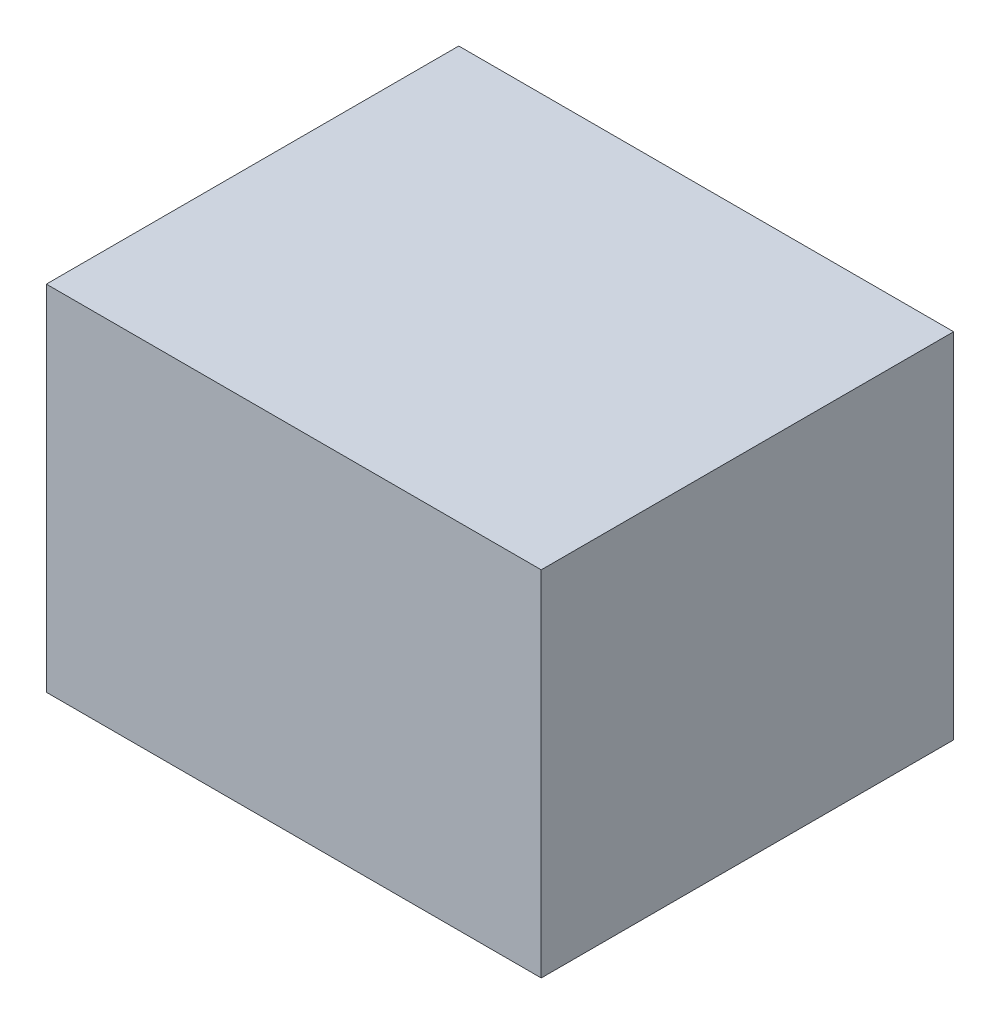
ISO-10303-21;
HEADER;
FILE_DESCRIPTION(('STEP AP214'),'2;1');
FILE_NAME('part.step','',(''),(''),'','','');
FILE_SCHEMA(('AUTOMOTIVE_DESIGN { 1 0 10303 214 1 1 1 1 }'));
ENDSEC;
DATA;
#1=APPLICATION_CONTEXT('core data for automotive mechanical design processes');
#2=APPLICATION_PROTOCOL_DEFINITION('international standard','automotive_design',2000,#1);
#3=PRODUCT_CONTEXT('',#1,'mechanical');
#4=PRODUCT('Part','Part','',(#3));
#5=PRODUCT_RELATED_PRODUCT_CATEGORY('part','',(#4));
#6=PRODUCT_DEFINITION_FORMATION('','',#4);
#7=PRODUCT_DEFINITION_CONTEXT('part definition',#1,'design');
#8=PRODUCT_DEFINITION('design','',#6,#7);
#9=PRODUCT_DEFINITION_SHAPE('','',#8);
#10=(LENGTH_UNIT() NAMED_UNIT(*) SI_UNIT(.MILLI.,.METRE.));
#11=(NAMED_UNIT(*) PLANE_ANGLE_UNIT() SI_UNIT($,.RADIAN.));
#12=(NAMED_UNIT(*) SI_UNIT($,.STERADIAN.) SOLID_ANGLE_UNIT());
#13=UNCERTAINTY_MEASURE_WITH_UNIT(LENGTH_MEASURE(1.E-05),#10,'distance_accuracy_value','');
#14=(GEOMETRIC_REPRESENTATION_CONTEXT(3) GLOBAL_UNCERTAINTY_ASSIGNED_CONTEXT((#13)) GLOBAL_UNIT_ASSIGNED_CONTEXT((#10,
#11,#12)) REPRESENTATION_CONTEXT('',''));
#15=CARTESIAN_POINT('',(0.,0.,0.));
#16=DIRECTION('',(0.,0.,1.));
#17=DIRECTION('',(1.,0.,0.));
#18=AXIS2_PLACEMENT_3D('',#15,#16,#17);
#19=CARTESIAN_POINT('',(210.,-150.,350.));
#20=DIRECTION('',(-1.,0.,0.));
#21=DIRECTION('',(0.,0.,1.));
#22=AXIS2_PLACEMENT_3D('',#19,#20,#21);
#23=PLANE('',#22);
#24=DIRECTION('',(0.,1.,0.));
#25=VECTOR('',#24,1.);
#26=CARTESIAN_POINT('',(210.,-150.,0.));
#27=LINE('',#26,#25);
#28=CARTESIAN_POINT('',(210.,-150.,0.));
#29=VERTEX_POINT('',#28);
#30=CARTESIAN_POINT('',(210.,150.,0.));
#31=VERTEX_POINT('',#30);
#32=EDGE_CURVE('E113',#29,#31,#27,.T.);
#33=ORIENTED_EDGE('',*,*,#32,.T.);
#34=DIRECTION('',(0.,0.,-1.));
#35=VECTOR('',#34,1.);
#36=CARTESIAN_POINT('',(210.,150.,350.));
#37=LINE('',#36,#35);
#38=CARTESIAN_POINT('',(210.,150.,350.));
#39=VERTEX_POINT('',#38);
#40=EDGE_CURVE('E11',#39,#31,#37,.T.);
#41=ORIENTED_EDGE('',*,*,#40,.F.);
#42=DIRECTION('',(0.,1.,0.));
#43=VECTOR('',#42,1.);
#44=CARTESIAN_POINT('',(210.,-150.,350.));
#45=LINE('',#44,#43);
#46=CARTESIAN_POINT('',(210.,-150.,350.));
#47=VERTEX_POINT('',#46);
#48=EDGE_CURVE('E97',#47,#39,#45,.T.);
#49=ORIENTED_EDGE('',*,*,#48,.F.);
#50=DIRECTION('',(0.,0.,-1.));
#51=VECTOR('',#50,1.);
#52=CARTESIAN_POINT('',(210.,-150.,350.));
#53=LINE('',#52,#51);
#54=EDGE_CURVE('E109',#47,#29,#53,.T.);
#55=ORIENTED_EDGE('',*,*,#54,.T.);
#56=EDGE_LOOP('',(#33,#41,#49,#55));
#57=FACE_BOUND('',#56,.T.);
#58=ADVANCED_FACE('F45',(#57),#23,.F.);
#59=CARTESIAN_POINT('',(-210.,150.,350.));
#60=DIRECTION('',(0.,-1.,0.));
#61=DIRECTION('',(0.,0.,-1.));
#62=AXIS2_PLACEMENT_3D('',#59,#60,#61);
#63=PLANE('',#62);
#64=DIRECTION('',(-1.,0.,0.));
#65=VECTOR('',#64,1.);
#66=CARTESIAN_POINT('',(-210.,150.,0.));
#67=LINE('',#66,#65);
#68=CARTESIAN_POINT('',(-210.,150.,0.));
#69=VERTEX_POINT('',#68);
#70=EDGE_CURVE('E102',#31,#69,#67,.T.);
#71=ORIENTED_EDGE('',*,*,#70,.T.);
#72=DIRECTION('',(0.,0.,-1.));
#73=VECTOR('',#72,1.);
#74=CARTESIAN_POINT('',(-210.,150.,350.));
#75=LINE('',#74,#73);
#76=CARTESIAN_POINT('',(-210.,150.,350.));
#77=VERTEX_POINT('',#76);
#78=EDGE_CURVE('E54',#77,#69,#75,.T.);
#79=ORIENTED_EDGE('',*,*,#78,.F.);
#80=DIRECTION('',(-1.,0.,0.));
#81=VECTOR('',#80,1.);
#82=CARTESIAN_POINT('',(-210.,150.,350.));
#83=LINE('',#82,#81);
#84=EDGE_CURVE('E92',#39,#77,#83,.T.);
#85=ORIENTED_EDGE('',*,*,#84,.F.);
#86=ORIENTED_EDGE('',*,*,#40,.T.);
#87=EDGE_LOOP('',(#71,#79,#85,#86));
#88=FACE_BOUND('',#87,.T.);
#89=ADVANCED_FACE('F101',(#88),#63,.F.);
#90=CARTESIAN_POINT('',(-210.,-150.,350.));
#91=DIRECTION('',(1.,0.,0.));
#92=DIRECTION('',(0.,0.,-1.));
#93=AXIS2_PLACEMENT_3D('',#90,#91,#92);
#94=PLANE('',#93);
#95=DIRECTION('',(0.,-1.,0.));
#96=VECTOR('',#95,1.);
#97=CARTESIAN_POINT('',(-210.,-150.,0.));
#98=LINE('',#97,#96);
#99=CARTESIAN_POINT('',(-210.,-150.,0.));
#100=VERTEX_POINT('',#99);
#101=EDGE_CURVE('E79',#69,#100,#98,.T.);
#102=ORIENTED_EDGE('',*,*,#101,.T.);
#103=DIRECTION('',(0.,0.,-1.));
#104=VECTOR('',#103,1.);
#105=CARTESIAN_POINT('',(-210.,-150.,350.));
#106=LINE('',#105,#104);
#107=CARTESIAN_POINT('',(-210.,-150.,350.));
#108=VERTEX_POINT('',#107);
#109=EDGE_CURVE('E104',#108,#100,#106,.T.);
#110=ORIENTED_EDGE('',*,*,#109,.F.);
#111=DIRECTION('',(0.,-1.,0.));
#112=VECTOR('',#111,1.);
#113=CARTESIAN_POINT('',(-210.,-150.,350.));
#114=LINE('',#113,#112);
#115=EDGE_CURVE('E95',#77,#108,#114,.T.);
#116=ORIENTED_EDGE('',*,*,#115,.F.);
#117=ORIENTED_EDGE('',*,*,#78,.T.);
#118=EDGE_LOOP('',(#102,#110,#116,#117));
#119=FACE_BOUND('',#118,.T.);
#120=ADVANCED_FACE('F105',(#119),#94,.F.);
#121=CARTESIAN_POINT('',(-210.,-150.,350.));
#122=DIRECTION('',(0.,1.,0.));
#123=DIRECTION('',(0.,0.,1.));
#124=AXIS2_PLACEMENT_3D('',#121,#122,#123);
#125=PLANE('',#124);
#126=DIRECTION('',(1.,0.,0.));
#127=VECTOR('',#126,1.);
#128=CARTESIAN_POINT('',(-210.,-150.,0.));
#129=LINE('',#128,#127);
#130=EDGE_CURVE('E85',#100,#29,#129,.T.);
#131=ORIENTED_EDGE('',*,*,#130,.T.);
#132=ORIENTED_EDGE('',*,*,#54,.F.);
#133=DIRECTION('',(1.,0.,0.));
#134=VECTOR('',#133,1.);
#135=CARTESIAN_POINT('',(-210.,-150.,350.));
#136=LINE('',#135,#134);
#137=EDGE_CURVE('E62',#108,#47,#136,.T.);
#138=ORIENTED_EDGE('',*,*,#137,.F.);
#139=ORIENTED_EDGE('',*,*,#109,.T.);
#140=EDGE_LOOP('',(#131,#132,#138,#139));
#141=FACE_BOUND('',#140,.T.);
#142=ADVANCED_FACE('F126',(#141),#125,.F.);
#143=CARTESIAN_POINT('',(0.,0.,350.));
#144=DIRECTION('',(0.,0.,-1.));
#145=DIRECTION('',(-1.,0.,0.));
#146=AXIS2_PLACEMENT_3D('',#143,#144,#145);
#147=PLANE('',#146);
#148=ORIENTED_EDGE('',*,*,#48,.T.);
#149=ORIENTED_EDGE('',*,*,#84,.T.);
#150=ORIENTED_EDGE('',*,*,#115,.T.);
#151=ORIENTED_EDGE('',*,*,#137,.T.);
#152=EDGE_LOOP('',(#148,#149,#150,#151));
#153=FACE_BOUND('',#152,.T.);
#154=ADVANCED_FACE('F93',(#153),#147,.F.);
#155=CARTESIAN_POINT('',(0.,0.,0.));
#156=DIRECTION('',(0.,0.,-1.));
#157=DIRECTION('',(-1.,0.,0.));
#158=AXIS2_PLACEMENT_3D('',#155,#156,#157);
#159=PLANE('',#158);
#160=ORIENTED_EDGE('',*,*,#32,.F.);
#161=ORIENTED_EDGE('',*,*,#130,.F.);
#162=ORIENTED_EDGE('',*,*,#101,.F.);
#163=ORIENTED_EDGE('',*,*,#70,.F.);
#164=EDGE_LOOP('',(#160,#161,#162,#163));
#165=FACE_BOUND('',#164,.T.);
#166=ADVANCED_FACE('F129',(#165),#159,.T.);
#167=CLOSED_SHELL('',(#58,#89,#120,#142,#154,#166));
#168=MANIFOLD_SOLID_BREP('B2',#167);
#169=ADVANCED_BREP_SHAPE_REPRESENTATION('',(#18,#168),#14);
#170=SHAPE_DEFINITION_REPRESENTATION(#9,#169);
ENDSEC;
END-ISO-10303-21;
